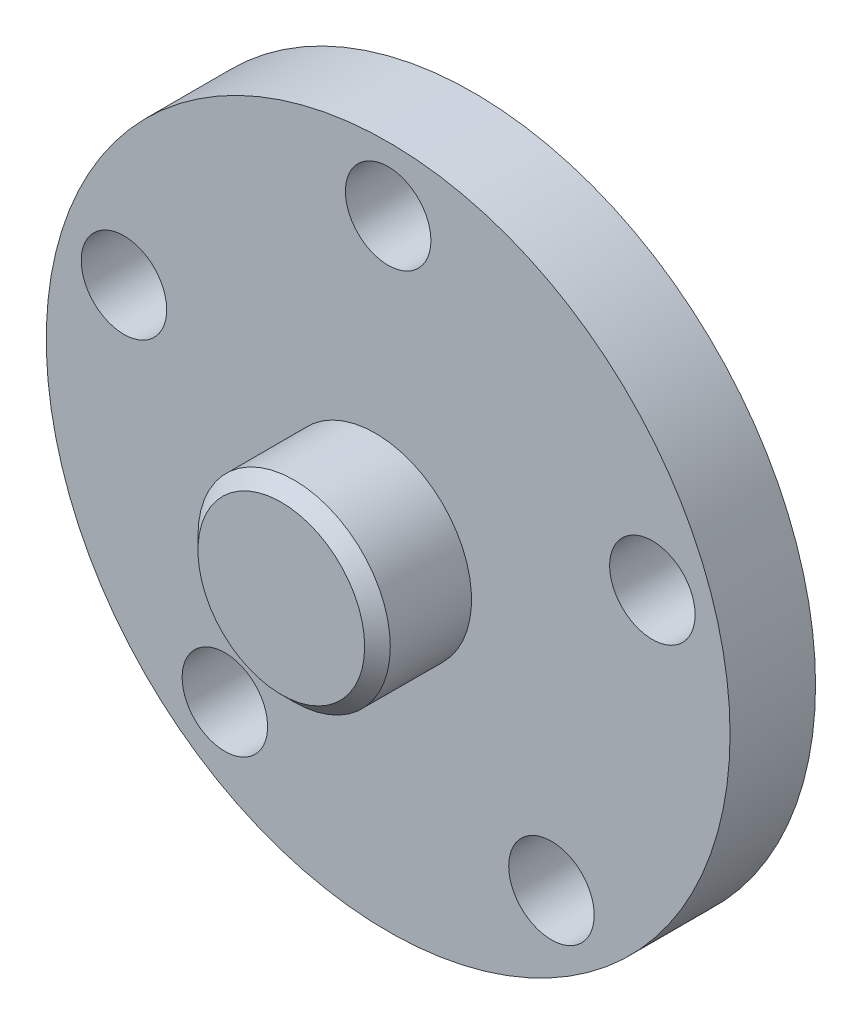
from build123d import *

# Parameters (mm, degrees)
SKETCH1_R          = 80
BASE_EXTRUDE_DEPTH = 20
CHAMFER1_SIZE      = 3
SKETCH3_R          = 10
CUT_EXTRUDE1_DEPTH = 116.866302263
CIRPATTERN1_COUNT  = 5


with BuildPart() as part:
    # Sketch1 → Base-Extrude (new body)
    with BuildSketch(Plane.XY):
        Circle(SKETCH1_R)
    extrude(amount=BASE_EXTRUDE_DEPTH)

    # Sketch2 → Boss-Revolve1 (revolve)
    with BuildSketch(Plane(origin=(0, 0, 0), x_dir=(1, 0, 0), z_dir=(0, 1, 0))):
        Polygon((-10, -20), (-10, -23), (-22.5, -23), (-22.5, -45), (0, -45), (0, -20), align=None)
    revolve(axis=Axis((0, 0, 0), (0, 0, 1)))

    # Chamfer1
    chamfer1_edges = [part.edges().sort_by_distance(p)[0] for p in [
        (22.5, 0, 45),
    ]]
    chamfer(chamfer1_edges, length=CHAMFER1_SIZE)

    # Sketch3 → Cut-Extrude1 (cut, through all)
    with BuildSketch(Plane.XY.offset(20)):
        with Locations((0, 65)):
            Circle(SKETCH3_R)
    cut_extrude1 = extrude(amount=-CUT_EXTRUDE1_DEPTH, mode=Mode.SUBTRACT)

    # CirPattern1: Cut-Extrude1 ×5 about axis
    cirpattern1_axis = Axis((0, 0, 0), (0, 0, 1))
    for i in range(1, CIRPATTERN1_COUNT):
        add(cut_extrude1.rotate(cirpattern1_axis, i * 360 / CIRPATTERN1_COUNT), mode=Mode.SUBTRACT)


solid = part.part
